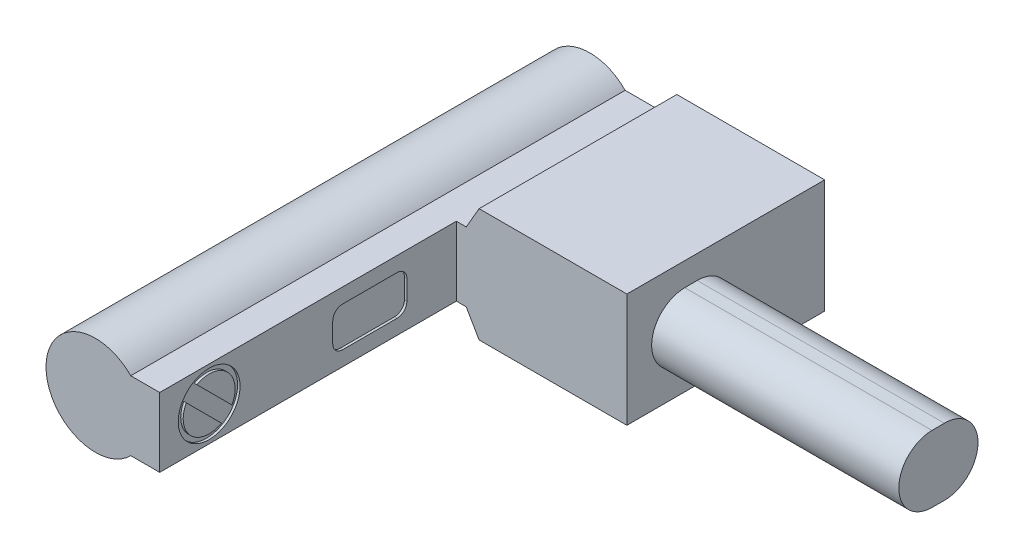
ISO-10303-21;
HEADER;
FILE_DESCRIPTION(('STEP AP214'),'2;1');
FILE_NAME('part.step','',(''),(''),'','','');
FILE_SCHEMA(('AUTOMOTIVE_DESIGN { 1 0 10303 214 1 1 1 1 }'));
ENDSEC;
DATA;
#1=APPLICATION_CONTEXT('core data for automotive mechanical design processes');
#2=APPLICATION_PROTOCOL_DEFINITION('international standard','automotive_design',2000,#1);
#3=PRODUCT_CONTEXT('',#1,'mechanical');
#4=PRODUCT('Part','Part','',(#3));
#5=PRODUCT_RELATED_PRODUCT_CATEGORY('part','',(#4));
#6=PRODUCT_DEFINITION_FORMATION('','',#4);
#7=PRODUCT_DEFINITION_CONTEXT('part definition',#1,'design');
#8=PRODUCT_DEFINITION('design','',#6,#7);
#9=PRODUCT_DEFINITION_SHAPE('','',#8);
#10=(LENGTH_UNIT() NAMED_UNIT(*) SI_UNIT(.MILLI.,.METRE.));
#11=(NAMED_UNIT(*) PLANE_ANGLE_UNIT() SI_UNIT($,.RADIAN.));
#12=(NAMED_UNIT(*) SI_UNIT($,.STERADIAN.) SOLID_ANGLE_UNIT());
#13=UNCERTAINTY_MEASURE_WITH_UNIT(LENGTH_MEASURE(1.E-05),#10,'distance_accuracy_value','');
#14=(GEOMETRIC_REPRESENTATION_CONTEXT(3) GLOBAL_UNCERTAINTY_ASSIGNED_CONTEXT((#13)) GLOBAL_UNIT_ASSIGNED_CONTEXT((#10,
#11,#12)) REPRESENTATION_CONTEXT('',''));
#15=CARTESIAN_POINT('',(0.,0.,0.));
#16=DIRECTION('',(0.,0.,1.));
#17=DIRECTION('',(1.,0.,0.));
#18=AXIS2_PLACEMENT_3D('',#15,#16,#17);
#19=CARTESIAN_POINT('',(2.6,-1.4,-20.));
#20=DIRECTION('',(1.,0.,0.));
#21=DIRECTION('',(0.,0.,-1.));
#22=AXIS2_PLACEMENT_3D('',#19,#20,#21);
#23=PLANE('',#22);
#24=DIRECTION('',(0.,0.707106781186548,0.707106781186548));
#25=VECTOR('',#24,1.);
#26=CARTESIAN_POINT('',(2.6,-0.609451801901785,-3.03371587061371));
#27=LINE('',#26,#25);
#28=CARTESIAN_POINT('',(2.6,0.92364450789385,-1.50061956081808));
#29=VERTEX_POINT('',#28);
#30=CARTESIAN_POINT('',(2.6,-0.499380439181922,-2.92364450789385));
#31=VERTEX_POINT('',#30);
#32=EDGE_CURVE('E146',#29,#31,#27,.F.);
#33=ORIENTED_EDGE('',*,*,#32,.T.);
#34=CARTESIAN_POINT('',(2.6,0.,-2.));
#35=DIRECTION('',(1.,0.,0.));
#36=DIRECTION('',(0.,0.,-1.));
#37=AXIS2_PLACEMENT_3D('',#34,#35,#36);
#38=CIRCLE('',#37,1.05);
#39=EDGE_CURVE('E20',#29,#31,#38,.F.);
#40=ORIENTED_EDGE('',*,*,#39,.F.);
#41=EDGE_LOOP('',(#33,#40));
#42=FACE_BOUND('',#41,.T.);
#43=ADVANCED_FACE('F17',(#42),#23,.T.);
#44=CARTESIAN_POINT('',(2.6,-1.4,-20.));
#45=DIRECTION('',(1.,0.,0.));
#46=DIRECTION('',(0.,0.,-1.));
#47=AXIS2_PLACEMENT_3D('',#44,#45,#46);
#48=PLANE('',#47);
#49=DIRECTION('',(0.,-0.707106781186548,-0.707106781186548));
#50=VECTOR('',#49,1.);
#51=CARTESIAN_POINT('',(2.6,0.609451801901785,-0.966284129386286));
#52=LINE('',#51,#50);
#53=CARTESIAN_POINT('',(2.6,-0.92364450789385,-2.49938043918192));
#54=VERTEX_POINT('',#53);
#55=CARTESIAN_POINT('',(2.6,0.499380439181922,-1.07635549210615));
#56=VERTEX_POINT('',#55);
#57=EDGE_CURVE('E167',#54,#56,#52,.F.);
#58=ORIENTED_EDGE('',*,*,#57,.T.);
#59=CARTESIAN_POINT('',(2.6,0.,-2.));
#60=DIRECTION('',(1.,0.,0.));
#61=DIRECTION('',(0.,0.,-1.));
#62=AXIS2_PLACEMENT_3D('',#59,#60,#61);
#63=CIRCLE('',#62,1.05);
#64=EDGE_CURVE('E158',#54,#56,#63,.F.);
#65=ORIENTED_EDGE('',*,*,#64,.F.);
#66=EDGE_LOOP('',(#58,#65));
#67=FACE_BOUND('',#66,.T.);
#68=ADVANCED_FACE('F560',(#67),#48,.T.);
#69=CARTESIAN_POINT('',(2.5,-0.609451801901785,-3.03371587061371));
#70=DIRECTION('',(0.,0.707106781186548,-0.707106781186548));
#71=DIRECTION('',(0.,0.707106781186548,0.707106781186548));
#72=AXIS2_PLACEMENT_3D('',#69,#70,#71);
#73=PLANE('',#72);
#74=DIRECTION('',(0.,0.707106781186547,0.707106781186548));
#75=VECTOR('',#74,1.);
#76=CARTESIAN_POINT('',(2.5,-0.499380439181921,-2.92364450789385));
#77=LINE('',#76,#75);
#78=CARTESIAN_POINT('',(2.5,-0.499380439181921,-2.92364450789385));
#79=VERTEX_POINT('',#78);
#80=CARTESIAN_POINT('',(2.5,0.92364450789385,-1.50061956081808));
#81=VERTEX_POINT('',#80);
#82=EDGE_CURVE('E162',#79,#81,#77,.T.);
#83=ORIENTED_EDGE('',*,*,#82,.F.);
#84=DIRECTION('',(1.,0.,0.));
#85=VECTOR('',#84,1.);
#86=CARTESIAN_POINT('',(2.5,-0.499380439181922,-2.92364450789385));
#87=LINE('',#86,#85);
#88=EDGE_CURVE('E154',#31,#79,#87,.F.);
#89=ORIENTED_EDGE('',*,*,#88,.F.);
#90=ORIENTED_EDGE('',*,*,#32,.F.);
#91=DIRECTION('',(1.,0.,0.));
#92=VECTOR('',#91,1.);
#93=CARTESIAN_POINT('',(2.5,0.923644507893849,-1.50061956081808));
#94=LINE('',#93,#92);
#95=EDGE_CURVE('E156',#81,#29,#94,.T.);
#96=ORIENTED_EDGE('',*,*,#95,.F.);
#97=EDGE_LOOP('',(#83,#89,#90,#96));
#98=FACE_BOUND('',#97,.T.);
#99=ADVANCED_FACE('F160',(#98),#73,.F.);
#100=CARTESIAN_POINT('',(2.5,0.,-2.));
#101=DIRECTION('',(1.,0.,0.));
#102=DIRECTION('',(0.,0.,-1.));
#103=AXIS2_PLACEMENT_3D('',#100,#101,#102);
#104=CYLINDRICAL_SURFACE('',#103,1.05);
#105=ORIENTED_EDGE('',*,*,#95,.T.);
#106=ORIENTED_EDGE('',*,*,#39,.T.);
#107=ORIENTED_EDGE('',*,*,#88,.T.);
#108=CARTESIAN_POINT('',(2.5,0.,-2.));
#109=DIRECTION('',(1.,0.,0.));
#110=DIRECTION('',(0.,0.,-1.));
#111=AXIS2_PLACEMENT_3D('',#108,#109,#110);
#112=CIRCLE('',#111,1.05);
#113=EDGE_CURVE('E238',#81,#79,#112,.F.);
#114=ORIENTED_EDGE('',*,*,#113,.F.);
#115=EDGE_LOOP('',(#105,#106,#107,#114));
#116=FACE_BOUND('',#115,.T.);
#117=ADVANCED_FACE('F152',(#116),#104,.T.);
#118=CARTESIAN_POINT('',(2.5,0.,-2.));
#119=DIRECTION('',(1.,0.,0.));
#120=DIRECTION('',(0.,0.,-1.));
#121=AXIS2_PLACEMENT_3D('',#118,#119,#120);
#122=CYLINDRICAL_SURFACE('',#121,1.05);
#123=DIRECTION('',(1.,0.,0.));
#124=VECTOR('',#123,1.);
#125=CARTESIAN_POINT('',(2.5,0.499380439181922,-1.07635549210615));
#126=LINE('',#125,#124);
#127=CARTESIAN_POINT('',(2.5,0.499380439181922,-1.07635549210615));
#128=VERTEX_POINT('',#127);
#129=EDGE_CURVE('E168',#56,#128,#126,.F.);
#130=ORIENTED_EDGE('',*,*,#129,.T.);
#131=CARTESIAN_POINT('',(2.5,0.,-2.));
#132=DIRECTION('',(1.,0.,0.));
#133=DIRECTION('',(0.,0.,-1.));
#134=AXIS2_PLACEMENT_3D('',#131,#132,#133);
#135=CIRCLE('',#134,1.05);
#136=CARTESIAN_POINT('',(2.5,-0.92364450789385,-2.49938043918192));
#137=VERTEX_POINT('',#136);
#138=EDGE_CURVE('E234',#137,#128,#135,.F.);
#139=ORIENTED_EDGE('',*,*,#138,.F.);
#140=DIRECTION('',(1.,0.,0.));
#141=VECTOR('',#140,1.);
#142=CARTESIAN_POINT('',(2.5,-0.92364450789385,-2.49938043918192));
#143=LINE('',#142,#141);
#144=EDGE_CURVE('E246',#137,#54,#143,.T.);
#145=ORIENTED_EDGE('',*,*,#144,.T.);
#146=ORIENTED_EDGE('',*,*,#64,.T.);
#147=EDGE_LOOP('',(#130,#139,#145,#146));
#148=FACE_BOUND('',#147,.T.);
#149=ADVANCED_FACE('F243',(#148),#122,.T.);
#150=CARTESIAN_POINT('',(2.5,0.609451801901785,-0.966284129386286));
#151=DIRECTION('',(0.,-0.707106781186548,0.707106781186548));
#152=DIRECTION('',(0.,-0.707106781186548,-0.707106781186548));
#153=AXIS2_PLACEMENT_3D('',#150,#151,#152);
#154=PLANE('',#153);
#155=DIRECTION('',(0.,-0.707106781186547,-0.707106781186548));
#156=VECTOR('',#155,1.);
#157=CARTESIAN_POINT('',(2.5,0.499380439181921,-1.07635549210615));
#158=LINE('',#157,#156);
#159=EDGE_CURVE('E237',#128,#137,#158,.T.);
#160=ORIENTED_EDGE('',*,*,#159,.F.);
#161=ORIENTED_EDGE('',*,*,#129,.F.);
#162=ORIENTED_EDGE('',*,*,#57,.F.);
#163=ORIENTED_EDGE('',*,*,#144,.F.);
#164=EDGE_LOOP('',(#160,#161,#162,#163));
#165=FACE_BOUND('',#164,.T.);
#166=ADVANCED_FACE('F250',(#165),#154,.F.);
#167=CARTESIAN_POINT('',(19.5,-1.3499756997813,-14.3419));
#168=DIRECTION('',(0.,0.999981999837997,-0.00599999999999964));
#169=DIRECTION('',(0.,0.00599999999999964,0.999981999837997));
#170=AXIS2_PLACEMENT_3D('',#167,#168,#169);
#171=PLANE('',#170);
#172=DIRECTION('',(-1.,0.,0.));
#173=VECTOR('',#172,1.);
#174=CARTESIAN_POINT('',(19.5,-1.35297564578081,-14.841882));
#175=LINE('',#174,#173);
#176=CARTESIAN_POINT('',(19.5,-1.35297564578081,-14.841882));
#177=VERTEX_POINT('',#176);
#178=CARTESIAN_POINT('',(9.5,-1.35297564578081,-14.841882));
#179=VERTEX_POINT('',#178);
#180=EDGE_CURVE('E229',#177,#179,#175,.T.);
#181=ORIENTED_EDGE('',*,*,#180,.F.);
#182=DIRECTION('',(0.,-0.00599999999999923,-0.999981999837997));
#183=VECTOR('',#182,1.);
#184=CARTESIAN_POINT('',(19.5,-1.3499756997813,-14.3419));
#185=LINE('',#184,#183);
#186=CARTESIAN_POINT('',(19.5,-1.3499756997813,-14.3419));
#187=VERTEX_POINT('',#186);
#188=EDGE_CURVE('E257',#187,#177,#185,.T.);
#189=ORIENTED_EDGE('',*,*,#188,.F.);
#190=DIRECTION('',(-1.,0.,0.));
#191=VECTOR('',#190,1.);
#192=CARTESIAN_POINT('',(19.5,-1.3499756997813,-14.3419));
#193=LINE('',#192,#191);
#194=CARTESIAN_POINT('',(9.5,-1.3499756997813,-14.3419));
#195=VERTEX_POINT('',#194);
#196=EDGE_CURVE('E273',#195,#187,#193,.F.);
#197=ORIENTED_EDGE('',*,*,#196,.F.);
#198=DIRECTION('',(0.,0.00599999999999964,0.999981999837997));
#199=VECTOR('',#198,1.);
#200=CARTESIAN_POINT('',(9.5,-1.3499756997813,-14.3419));
#201=LINE('',#200,#199);
#202=EDGE_CURVE('E253',#179,#195,#201,.T.);
#203=ORIENTED_EDGE('',*,*,#202,.F.);
#204=EDGE_LOOP('',(#181,#189,#197,#203));
#205=FACE_BOUND('',#204,.T.);
#206=ADVANCED_FACE('F536',(#205),#171,.F.);
#207=CARTESIAN_POINT('',(19.5,0.,-14.35));
#208=DIRECTION('',(1.,0.,0.));
#209=DIRECTION('',(0.,0.,-1.));
#210=AXIS2_PLACEMENT_3D('',#207,#208,#209);
#211=PLANE('',#210);
#212=CARTESIAN_POINT('',(19.5,0.,-14.85));
#213=DIRECTION('',(-1.,0.,0.));
#214=DIRECTION('',(0.,0.,1.));
#215=AXIS2_PLACEMENT_3D('',#212,#213,#214);
#216=CIRCLE('',#215,1.353);
#217=CARTESIAN_POINT('',(19.5,1.35297564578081,-14.841882));
#218=VERTEX_POINT('',#217);
#219=EDGE_CURVE('E230',#218,#177,#216,.T.);
#220=ORIENTED_EDGE('',*,*,#219,.F.);
#221=DIRECTION('',(0.,0.00599999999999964,-0.999981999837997));
#222=VECTOR('',#221,1.);
#223=CARTESIAN_POINT('',(19.5,1.35297564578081,-14.841882));
#224=LINE('',#223,#222);
#225=CARTESIAN_POINT('',(19.5,1.3499756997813,-14.3419));
#226=VERTEX_POINT('',#225);
#227=EDGE_CURVE('E259',#218,#226,#224,.F.);
#228=ORIENTED_EDGE('',*,*,#227,.T.);
#229=CARTESIAN_POINT('',(19.5,0.,-14.35));
#230=DIRECTION('',(-1.,0.,0.));
#231=DIRECTION('',(0.,0.,1.));
#232=AXIS2_PLACEMENT_3D('',#229,#230,#231);
#233=CIRCLE('',#232,1.35);
#234=EDGE_CURVE('E226',#187,#226,#233,.T.);
#235=ORIENTED_EDGE('',*,*,#234,.F.);
#236=ORIENTED_EDGE('',*,*,#188,.T.);
#237=EDGE_LOOP('',(#220,#228,#235,#236));
#238=FACE_BOUND('',#237,.T.);
#239=ADVANCED_FACE('F541',(#238),#211,.T.);
#240=CARTESIAN_POINT('',(19.5,1.35297564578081,-14.841882));
#241=DIRECTION('',(0.,-0.999981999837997,-0.00599999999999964));
#242=DIRECTION('',(0.,0.00599999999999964,-0.999981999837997));
#243=AXIS2_PLACEMENT_3D('',#240,#241,#242);
#244=PLANE('',#243);
#245=DIRECTION('',(-1.,0.,0.));
#246=VECTOR('',#245,1.);
#247=CARTESIAN_POINT('',(19.5,1.3499756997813,-14.3419));
#248=LINE('',#247,#246);
#249=CARTESIAN_POINT('',(9.5,1.3499756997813,-14.3419));
#250=VERTEX_POINT('',#249);
#251=EDGE_CURVE('E225',#226,#250,#248,.T.);
#252=ORIENTED_EDGE('',*,*,#251,.F.);
#253=ORIENTED_EDGE('',*,*,#227,.F.);
#254=DIRECTION('',(-1.,0.,0.));
#255=VECTOR('',#254,1.);
#256=CARTESIAN_POINT('',(19.5,1.35297564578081,-14.841882));
#257=LINE('',#256,#255);
#258=CARTESIAN_POINT('',(9.5,1.35297564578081,-14.841882));
#259=VERTEX_POINT('',#258);
#260=EDGE_CURVE('E233',#259,#218,#257,.F.);
#261=ORIENTED_EDGE('',*,*,#260,.F.);
#262=DIRECTION('',(0.,0.00599999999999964,-0.999981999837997));
#263=VECTOR('',#262,1.);
#264=CARTESIAN_POINT('',(9.5,1.35297564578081,-14.841882));
#265=LINE('',#264,#263);
#266=EDGE_CURVE('E261',#250,#259,#265,.T.);
#267=ORIENTED_EDGE('',*,*,#266,.F.);
#268=EDGE_LOOP('',(#252,#253,#261,#267));
#269=FACE_BOUND('',#268,.T.);
#270=ADVANCED_FACE('F529',(#269),#244,.F.);
#271=CARTESIAN_POINT('',(2.5,-0.400000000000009,-7.4));
#272=DIRECTION('',(1.,0.,0.));
#273=DIRECTION('',(0.,0.,-1.));
#274=AXIS2_PLACEMENT_3D('',#271,#272,#273);
#275=PLANE('',#274);
#276=CARTESIAN_POINT('',(2.5,0.399999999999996,-7.4));
#277=DIRECTION('',(1.,0.,0.));
#278=DIRECTION('',(0.,0.,-1.));
#279=AXIS2_PLACEMENT_3D('',#276,#277,#278);
#280=CIRCLE('',#279,0.4);
#281=CARTESIAN_POINT('',(2.5,0.799999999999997,-7.4));
#282=VERTEX_POINT('',#281);
#283=CARTESIAN_POINT('',(2.5,0.399999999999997,-7.));
#284=VERTEX_POINT('',#283);
#285=EDGE_CURVE('E218',#282,#284,#280,.T.);
#286=ORIENTED_EDGE('',*,*,#285,.T.);
#287=DIRECTION('',(0.,1.,0.));
#288=VECTOR('',#287,1.);
#289=CARTESIAN_POINT('',(2.5,0.399999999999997,-7.));
#290=LINE('',#289,#288);
#291=CARTESIAN_POINT('',(2.5,-0.40000000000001,-7.));
#292=VERTEX_POINT('',#291);
#293=EDGE_CURVE('E224',#284,#292,#290,.F.);
#294=ORIENTED_EDGE('',*,*,#293,.T.);
#295=CARTESIAN_POINT('',(2.5,-0.400000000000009,-7.4));
#296=DIRECTION('',(1.,0.,0.));
#297=DIRECTION('',(0.,0.,-1.));
#298=AXIS2_PLACEMENT_3D('',#295,#296,#297);
#299=CIRCLE('',#298,0.400000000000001);
#300=CARTESIAN_POINT('',(2.5,-0.80000000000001,-7.4));
#301=VERTEX_POINT('',#300);
#302=EDGE_CURVE('E222',#292,#301,#299,.T.);
#303=ORIENTED_EDGE('',*,*,#302,.T.);
#304=DIRECTION('',(0.,0.,-1.));
#305=VECTOR('',#304,1.);
#306=CARTESIAN_POINT('',(2.5,-0.80000000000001,-7.4));
#307=LINE('',#306,#305);
#308=CARTESIAN_POINT('',(2.5,-0.800000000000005,-9.6));
#309=VERTEX_POINT('',#308);
#310=EDGE_CURVE('E268',#301,#309,#307,.T.);
#311=ORIENTED_EDGE('',*,*,#310,.T.);
#312=CARTESIAN_POINT('',(2.5,-0.400000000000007,-9.6));
#313=DIRECTION('',(1.,0.,0.));
#314=DIRECTION('',(0.,0.,-1.));
#315=AXIS2_PLACEMENT_3D('',#312,#313,#314);
#316=CIRCLE('',#315,0.399999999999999);
#317=CARTESIAN_POINT('',(2.5,-0.400000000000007,-10.));
#318=VERTEX_POINT('',#317);
#319=EDGE_CURVE('E210',#309,#318,#316,.T.);
#320=ORIENTED_EDGE('',*,*,#319,.T.);
#321=DIRECTION('',(0.,1.,0.));
#322=VECTOR('',#321,1.);
#323=CARTESIAN_POINT('',(2.5,-0.400000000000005,-10.));
#324=LINE('',#323,#322);
#325=CARTESIAN_POINT('',(2.5,0.399999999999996,-10.));
#326=VERTEX_POINT('',#325);
#327=EDGE_CURVE('E266',#318,#326,#324,.T.);
#328=ORIENTED_EDGE('',*,*,#327,.T.);
#329=CARTESIAN_POINT('',(2.5,0.399999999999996,-9.6));
#330=DIRECTION('',(1.,0.,0.));
#331=DIRECTION('',(0.,0.,-1.));
#332=AXIS2_PLACEMENT_3D('',#329,#330,#331);
#333=CIRCLE('',#332,0.400000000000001);
#334=CARTESIAN_POINT('',(2.5,0.799999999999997,-9.6));
#335=VERTEX_POINT('',#334);
#336=EDGE_CURVE('E214',#326,#335,#333,.T.);
#337=ORIENTED_EDGE('',*,*,#336,.T.);
#338=DIRECTION('',(0.,0.,1.));
#339=VECTOR('',#338,1.);
#340=CARTESIAN_POINT('',(2.5,0.799999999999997,-9.6));
#341=LINE('',#340,#339);
#342=EDGE_CURVE('E264',#335,#282,#341,.T.);
#343=ORIENTED_EDGE('',*,*,#342,.T.);
#344=EDGE_LOOP('',(#286,#294,#303,#311,#320,#328,#337,#343));
#345=FACE_BOUND('',#344,.T.);
#346=ADVANCED_FACE('F548',(#345),#275,.T.);
#347=CARTESIAN_POINT('',(2.5,0.,-2.));
#348=DIRECTION('',(1.,0.,0.));
#349=DIRECTION('',(0.,0.,-1.));
#350=AXIS2_PLACEMENT_3D('',#347,#348,#349);
#351=PLANE('',#350);
#352=CARTESIAN_POINT('',(2.5,0.,-2.));
#353=DIRECTION('',(1.,0.,0.));
#354=DIRECTION('',(0.,0.,-1.));
#355=AXIS2_PLACEMENT_3D('',#352,#353,#354);
#356=CIRCLE('',#355,1.25);
#357=CARTESIAN_POINT('',(2.5,0.,-3.25));
#358=VERTEX_POINT('',#357);
#359=EDGE_CURVE('E205',#358,#358,#356,.T.);
#360=ORIENTED_EDGE('',*,*,#359,.T.);
#361=EDGE_LOOP('',(#360));
#362=FACE_BOUND('',#361,.T.);
#363=ORIENTED_EDGE('',*,*,#138,.T.);
#364=ORIENTED_EDGE('',*,*,#159,.T.);
#365=EDGE_LOOP('',(#363,#364));
#366=FACE_BOUND('',#365,.T.);
#367=ORIENTED_EDGE('',*,*,#82,.T.);
#368=ORIENTED_EDGE('',*,*,#113,.T.);
#369=EDGE_LOOP('',(#367,#368));
#370=FACE_BOUND('',#369,.T.);
#371=ADVANCED_FACE('F625',(#362,#366,#370),#351,.T.);
#372=CARTESIAN_POINT('',(19.5,0.,-14.85));
#373=DIRECTION('',(-1.,0.,0.));
#374=DIRECTION('',(0.,0.,1.));
#375=AXIS2_PLACEMENT_3D('',#372,#373,#374);
#376=CYLINDRICAL_SURFACE('',#375,1.353);
#377=ORIENTED_EDGE('',*,*,#219,.T.);
#378=ORIENTED_EDGE('',*,*,#180,.T.);
#379=CARTESIAN_POINT('',(9.5,0.,-14.85));
#380=DIRECTION('',(-1.,0.,0.));
#381=DIRECTION('',(0.,0.,1.));
#382=AXIS2_PLACEMENT_3D('',#379,#380,#381);
#383=CIRCLE('',#382,1.353);
#384=EDGE_CURVE('E201',#179,#259,#383,.F.);
#385=ORIENTED_EDGE('',*,*,#384,.T.);
#386=ORIENTED_EDGE('',*,*,#260,.T.);
#387=EDGE_LOOP('',(#377,#378,#385,#386));
#388=FACE_BOUND('',#387,.T.);
#389=ADVANCED_FACE('F532',(#388),#376,.T.);
#390=CARTESIAN_POINT('',(19.5,0.,-14.35));
#391=DIRECTION('',(-1.,0.,0.));
#392=DIRECTION('',(0.,0.,1.));
#393=AXIS2_PLACEMENT_3D('',#390,#391,#392);
#394=CYLINDRICAL_SURFACE('',#393,1.35);
#395=ORIENTED_EDGE('',*,*,#251,.T.);
#396=CARTESIAN_POINT('',(9.5,0.,-14.35));
#397=DIRECTION('',(-1.,0.,0.));
#398=DIRECTION('',(0.,0.,1.));
#399=AXIS2_PLACEMENT_3D('',#396,#397,#398);
#400=CIRCLE('',#399,1.35);
#401=EDGE_CURVE('E198',#250,#195,#400,.F.);
#402=ORIENTED_EDGE('',*,*,#401,.T.);
#403=ORIENTED_EDGE('',*,*,#196,.T.);
#404=ORIENTED_EDGE('',*,*,#234,.T.);
#405=EDGE_LOOP('',(#395,#402,#403,#404));
#406=FACE_BOUND('',#405,.T.);
#407=ADVANCED_FACE('F539',(#406),#394,.T.);
#408=CARTESIAN_POINT('',(2.5,-0.400000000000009,-7.4));
#409=DIRECTION('',(1.,0.,0.));
#410=DIRECTION('',(0.,0.,-1.));
#411=AXIS2_PLACEMENT_3D('',#408,#409,#410);
#412=CYLINDRICAL_SURFACE('',#411,0.400000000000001);
#413=DIRECTION('',(1.,0.,0.));
#414=VECTOR('',#413,1.);
#415=CARTESIAN_POINT('',(2.5,-0.80000000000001,-7.4));
#416=LINE('',#415,#414);
#417=CARTESIAN_POINT('',(2.6,-0.800000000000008,-7.4));
#418=VERTEX_POINT('',#417);
#419=EDGE_CURVE('E270',#418,#301,#416,.F.);
#420=ORIENTED_EDGE('',*,*,#419,.T.);
#421=ORIENTED_EDGE('',*,*,#302,.F.);
#422=DIRECTION('',(1.,0.,0.));
#423=VECTOR('',#422,1.);
#424=CARTESIAN_POINT('',(2.5,-0.40000000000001,-7.));
#425=LINE('',#424,#423);
#426=CARTESIAN_POINT('',(2.6,-0.40000000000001,-7.));
#427=VERTEX_POINT('',#426);
#428=EDGE_CURVE('E221',#292,#427,#425,.T.);
#429=ORIENTED_EDGE('',*,*,#428,.T.);
#430=CARTESIAN_POINT('',(2.6,-0.400000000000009,-7.4));
#431=DIRECTION('',(1.,0.,0.));
#432=DIRECTION('',(0.,0.,-1.));
#433=AXIS2_PLACEMENT_3D('',#430,#431,#432);
#434=CIRCLE('',#433,0.400000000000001);
#435=EDGE_CURVE('E194',#418,#427,#434,.F.);
#436=ORIENTED_EDGE('',*,*,#435,.F.);
#437=EDGE_LOOP('',(#420,#421,#429,#436));
#438=FACE_BOUND('',#437,.T.);
#439=ADVANCED_FACE('F651',(#438),#412,.F.);
#440=CARTESIAN_POINT('',(2.5,0.399999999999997,-7.));
#441=DIRECTION('',(0.,0.,1.));
#442=DIRECTION('',(1.,0.,0.));
#443=AXIS2_PLACEMENT_3D('',#440,#441,#442);
#444=PLANE('',#443);
#445=ORIENTED_EDGE('',*,*,#428,.F.);
#446=ORIENTED_EDGE('',*,*,#293,.F.);
#447=DIRECTION('',(1.,0.,0.));
#448=VECTOR('',#447,1.);
#449=CARTESIAN_POINT('',(2.5,0.399999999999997,-7.));
#450=LINE('',#449,#448);
#451=CARTESIAN_POINT('',(2.6,0.399999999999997,-7.));
#452=VERTEX_POINT('',#451);
#453=EDGE_CURVE('E220',#284,#452,#450,.T.);
#454=ORIENTED_EDGE('',*,*,#453,.T.);
#455=DIRECTION('',(0.,1.,0.));
#456=VECTOR('',#455,1.);
#457=CARTESIAN_POINT('',(2.6,-1.4,-7.));
#458=LINE('',#457,#456);
#459=EDGE_CURVE('E193',#427,#452,#458,.T.);
#460=ORIENTED_EDGE('',*,*,#459,.F.);
#461=EDGE_LOOP('',(#445,#446,#454,#460));
#462=FACE_BOUND('',#461,.T.);
#463=ADVANCED_FACE('F660',(#462),#444,.F.);
#464=CARTESIAN_POINT('',(2.5,0.399999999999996,-7.4));
#465=DIRECTION('',(1.,0.,0.));
#466=DIRECTION('',(0.,0.,-1.));
#467=AXIS2_PLACEMENT_3D('',#464,#465,#466);
#468=CYLINDRICAL_SURFACE('',#467,0.4);
#469=ORIENTED_EDGE('',*,*,#453,.F.);
#470=ORIENTED_EDGE('',*,*,#285,.F.);
#471=DIRECTION('',(1.,0.,0.));
#472=VECTOR('',#471,1.);
#473=CARTESIAN_POINT('',(2.5,0.799999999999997,-7.4));
#474=LINE('',#473,#472);
#475=CARTESIAN_POINT('',(2.6,0.799999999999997,-7.4));
#476=VERTEX_POINT('',#475);
#477=EDGE_CURVE('E217',#282,#476,#474,.T.);
#478=ORIENTED_EDGE('',*,*,#477,.T.);
#479=CARTESIAN_POINT('',(2.6,0.399999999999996,-7.4));
#480=DIRECTION('',(1.,0.,0.));
#481=DIRECTION('',(0.,0.,-1.));
#482=AXIS2_PLACEMENT_3D('',#479,#480,#481);
#483=CIRCLE('',#482,0.4);
#484=EDGE_CURVE('E190',#452,#476,#483,.F.);
#485=ORIENTED_EDGE('',*,*,#484,.F.);
#486=EDGE_LOOP('',(#469,#470,#478,#485));
#487=FACE_BOUND('',#486,.T.);
#488=ADVANCED_FACE('F670',(#487),#468,.F.);
#489=CARTESIAN_POINT('',(2.5,0.799999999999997,-9.6));
#490=DIRECTION('',(0.,1.,0.));
#491=DIRECTION('',(0.,0.,1.));
#492=AXIS2_PLACEMENT_3D('',#489,#490,#491);
#493=PLANE('',#492);
#494=ORIENTED_EDGE('',*,*,#477,.F.);
#495=ORIENTED_EDGE('',*,*,#342,.F.);
#496=DIRECTION('',(1.,0.,0.));
#497=VECTOR('',#496,1.);
#498=CARTESIAN_POINT('',(2.5,0.799999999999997,-9.6));
#499=LINE('',#498,#497);
#500=CARTESIAN_POINT('',(2.6,0.799999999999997,-9.6));
#501=VERTEX_POINT('',#500);
#502=EDGE_CURVE('E216',#335,#501,#499,.T.);
#503=ORIENTED_EDGE('',*,*,#502,.T.);
#504=DIRECTION('',(0.,0.,-1.));
#505=VECTOR('',#504,1.);
#506=CARTESIAN_POINT('',(2.6,0.799999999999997,-20.));
#507=LINE('',#506,#505);
#508=EDGE_CURVE('E189',#476,#501,#507,.T.);
#509=ORIENTED_EDGE('',*,*,#508,.F.);
#510=EDGE_LOOP('',(#494,#495,#503,#509));
#511=FACE_BOUND('',#510,.T.);
#512=ADVANCED_FACE('F680',(#511),#493,.F.);
#513=CARTESIAN_POINT('',(2.5,0.399999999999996,-9.6));
#514=DIRECTION('',(1.,0.,0.));
#515=DIRECTION('',(0.,0.,-1.));
#516=AXIS2_PLACEMENT_3D('',#513,#514,#515);
#517=CYLINDRICAL_SURFACE('',#516,0.400000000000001);
#518=ORIENTED_EDGE('',*,*,#502,.F.);
#519=ORIENTED_EDGE('',*,*,#336,.F.);
#520=DIRECTION('',(-1.,0.,0.));
#521=VECTOR('',#520,1.);
#522=CARTESIAN_POINT('',(2.5,0.399999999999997,-10.));
#523=LINE('',#522,#521);
#524=CARTESIAN_POINT('',(2.6,0.399999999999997,-10.));
#525=VERTEX_POINT('',#524);
#526=EDGE_CURVE('E213',#326,#525,#523,.F.);
#527=ORIENTED_EDGE('',*,*,#526,.T.);
#528=CARTESIAN_POINT('',(2.6,0.399999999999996,-9.6));
#529=DIRECTION('',(1.,0.,0.));
#530=DIRECTION('',(0.,0.,-1.));
#531=AXIS2_PLACEMENT_3D('',#528,#529,#530);
#532=CIRCLE('',#531,0.400000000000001);
#533=EDGE_CURVE('E186',#501,#525,#532,.F.);
#534=ORIENTED_EDGE('',*,*,#533,.F.);
#535=EDGE_LOOP('',(#518,#519,#527,#534));
#536=FACE_BOUND('',#535,.T.);
#537=ADVANCED_FACE('F690',(#536),#517,.F.);
#538=CARTESIAN_POINT('',(2.5,-0.400000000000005,-10.));
#539=DIRECTION('',(0.,0.,-1.));
#540=DIRECTION('',(-1.,0.,0.));
#541=AXIS2_PLACEMENT_3D('',#538,#539,#540);
#542=PLANE('',#541);
#543=ORIENTED_EDGE('',*,*,#526,.F.);
#544=ORIENTED_EDGE('',*,*,#327,.F.);
#545=DIRECTION('',(1.,0.,0.));
#546=VECTOR('',#545,1.);
#547=CARTESIAN_POINT('',(2.5,-0.400000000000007,-10.));
#548=LINE('',#547,#546);
#549=CARTESIAN_POINT('',(2.6,-0.400000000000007,-10.));
#550=VERTEX_POINT('',#549);
#551=EDGE_CURVE('E212',#318,#550,#548,.T.);
#552=ORIENTED_EDGE('',*,*,#551,.T.);
#553=DIRECTION('',(0.,1.,0.));
#554=VECTOR('',#553,1.);
#555=CARTESIAN_POINT('',(2.6,-1.4,-10.));
#556=LINE('',#555,#554);
#557=EDGE_CURVE('E185',#525,#550,#556,.F.);
#558=ORIENTED_EDGE('',*,*,#557,.F.);
#559=EDGE_LOOP('',(#543,#544,#552,#558));
#560=FACE_BOUND('',#559,.T.);
#561=ADVANCED_FACE('F700',(#560),#542,.F.);
#562=CARTESIAN_POINT('',(2.5,-0.400000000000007,-9.6));
#563=DIRECTION('',(1.,0.,0.));
#564=DIRECTION('',(0.,0.,-1.));
#565=AXIS2_PLACEMENT_3D('',#562,#563,#564);
#566=CYLINDRICAL_SURFACE('',#565,0.399999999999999);
#567=ORIENTED_EDGE('',*,*,#551,.F.);
#568=ORIENTED_EDGE('',*,*,#319,.F.);
#569=DIRECTION('',(1.,0.,0.));
#570=VECTOR('',#569,1.);
#571=CARTESIAN_POINT('',(2.5,-0.800000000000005,-9.6));
#572=LINE('',#571,#570);
#573=CARTESIAN_POINT('',(2.6,-0.800000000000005,-9.6));
#574=VERTEX_POINT('',#573);
#575=EDGE_CURVE('E209',#309,#574,#572,.T.);
#576=ORIENTED_EDGE('',*,*,#575,.T.);
#577=CARTESIAN_POINT('',(2.6,-0.400000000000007,-9.6));
#578=DIRECTION('',(1.,0.,0.));
#579=DIRECTION('',(0.,0.,-1.));
#580=AXIS2_PLACEMENT_3D('',#577,#578,#579);
#581=CIRCLE('',#580,0.399999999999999);
#582=EDGE_CURVE('E182',#550,#574,#581,.F.);
#583=ORIENTED_EDGE('',*,*,#582,.F.);
#584=EDGE_LOOP('',(#567,#568,#576,#583));
#585=FACE_BOUND('',#584,.T.);
#586=ADVANCED_FACE('F710',(#585),#566,.F.);
#587=CARTESIAN_POINT('',(2.5,-0.80000000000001,-7.4));
#588=DIRECTION('',(0.,-1.,0.));
#589=DIRECTION('',(0.,0.,-1.));
#590=AXIS2_PLACEMENT_3D('',#587,#588,#589);
#591=PLANE('',#590);
#592=ORIENTED_EDGE('',*,*,#575,.F.);
#593=ORIENTED_EDGE('',*,*,#310,.F.);
#594=ORIENTED_EDGE('',*,*,#419,.F.);
#595=DIRECTION('',(0.,0.,-1.));
#596=VECTOR('',#595,1.);
#597=CARTESIAN_POINT('',(2.6,-0.800000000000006,-20.));
#598=LINE('',#597,#596);
#599=EDGE_CURVE('E181',#574,#418,#598,.F.);
#600=ORIENTED_EDGE('',*,*,#599,.F.);
#601=EDGE_LOOP('',(#592,#593,#594,#600));
#602=FACE_BOUND('',#601,.T.);
#603=ADVANCED_FACE('F720',(#602),#591,.F.);
#604=CARTESIAN_POINT('',(2.5,0.,-2.));
#605=DIRECTION('',(1.,0.,0.));
#606=DIRECTION('',(0.,0.,-1.));
#607=AXIS2_PLACEMENT_3D('',#604,#605,#606);
#608=CYLINDRICAL_SURFACE('',#607,1.25);
#609=CARTESIAN_POINT('',(2.6,0.,-2.));
#610=DIRECTION('',(1.,0.,0.));
#611=DIRECTION('',(0.,0.,-1.));
#612=AXIS2_PLACEMENT_3D('',#609,#610,#611);
#613=CIRCLE('',#612,1.25);
#614=CARTESIAN_POINT('',(2.6,0.,-3.25));
#615=VERTEX_POINT('',#614);
#616=EDGE_CURVE('E177',#615,#615,#613,.F.);
#617=ORIENTED_EDGE('',*,*,#616,.F.);
#618=EDGE_LOOP('',(#617));
#619=FACE_BOUND('',#618,.T.);
#620=ORIENTED_EDGE('',*,*,#359,.F.);
#621=EDGE_LOOP('',(#620));
#622=FACE_BOUND('',#621,.T.);
#623=ADVANCED_FACE('F499',(#619,#622),#608,.F.);
#624=CARTESIAN_POINT('',(0.,0.,-12.));
#625=DIRECTION('',(0.,0.,1.));
#626=DIRECTION('',(1.,0.,0.));
#627=AXIS2_PLACEMENT_3D('',#624,#625,#626);
#628=PLANE('',#627);
#629=DIRECTION('',(1.,0.,0.));
#630=VECTOR('',#629,1.);
#631=CARTESIAN_POINT('',(9.5,2.3,-12.));
#632=LINE('',#631,#630);
#633=CARTESIAN_POINT('',(9.5,2.3,-12.));
#634=VERTEX_POINT('',#633);
#635=CARTESIAN_POINT('',(3.51961524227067,2.3,-12.));
#636=VERTEX_POINT('',#635);
#637=EDGE_CURVE('E281',#634,#636,#632,.F.);
#638=ORIENTED_EDGE('',*,*,#637,.T.);
#639=DIRECTION('',(0.5,0.866025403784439,0.));
#640=VECTOR('',#639,1.);
#641=CARTESIAN_POINT('',(3.51961524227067,2.3,-12.));
#642=LINE('',#641,#640);
#643=CARTESIAN_POINT('',(3.,1.4,-12.));
#644=VERTEX_POINT('',#643);
#645=EDGE_CURVE('E324',#636,#644,#642,.F.);
#646=ORIENTED_EDGE('',*,*,#645,.T.);
#647=DIRECTION('',(1.,0.,0.));
#648=VECTOR('',#647,1.);
#649=CARTESIAN_POINT('',(0.,1.4,-12.));
#650=LINE('',#649,#648);
#651=CARTESIAN_POINT('',(2.6,1.4,-12.));
#652=VERTEX_POINT('',#651);
#653=EDGE_CURVE('E208',#644,#652,#650,.F.);
#654=ORIENTED_EDGE('',*,*,#653,.T.);
#655=DIRECTION('',(0.,1.,0.));
#656=VECTOR('',#655,1.);
#657=CARTESIAN_POINT('',(2.6,-1.4,-12.));
#658=LINE('',#657,#656);
#659=CARTESIAN_POINT('',(2.60000000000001,-1.4,-12.));
#660=VERTEX_POINT('',#659);
#661=EDGE_CURVE('E180',#660,#652,#658,.T.);
#662=ORIENTED_EDGE('',*,*,#661,.F.);
#663=DIRECTION('',(1.,0.,0.));
#664=VECTOR('',#663,1.);
#665=CARTESIAN_POINT('',(0.,-1.4,-12.));
#666=LINE('',#665,#664);
#667=CARTESIAN_POINT('',(3.,-1.4,-12.));
#668=VERTEX_POINT('',#667);
#669=EDGE_CURVE('E289',#660,#668,#666,.T.);
#670=ORIENTED_EDGE('',*,*,#669,.T.);
#671=DIRECTION('',(-0.5,0.866025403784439,0.));
#672=VECTOR('',#671,1.);
#673=CARTESIAN_POINT('',(3.,-1.4,-12.));
#674=LINE('',#673,#672);
#675=CARTESIAN_POINT('',(3.51961524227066,-2.3,-12.));
#676=VERTEX_POINT('',#675);
#677=EDGE_CURVE('E301',#668,#676,#674,.F.);
#678=ORIENTED_EDGE('',*,*,#677,.T.);
#679=DIRECTION('',(-1.,0.,0.));
#680=VECTOR('',#679,1.);
#681=CARTESIAN_POINT('',(3.51961524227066,-2.3,-12.));
#682=LINE('',#681,#680);
#683=CARTESIAN_POINT('',(9.5,-2.3,-12.));
#684=VERTEX_POINT('',#683);
#685=EDGE_CURVE('E311',#676,#684,#682,.F.);
#686=ORIENTED_EDGE('',*,*,#685,.T.);
#687=DIRECTION('',(0.,1.,0.));
#688=VECTOR('',#687,1.);
#689=CARTESIAN_POINT('',(9.5,-2.3,-12.));
#690=LINE('',#689,#688);
#691=EDGE_CURVE('E204',#684,#634,#690,.T.);
#692=ORIENTED_EDGE('',*,*,#691,.T.);
#693=EDGE_LOOP('',(#638,#646,#654,#662,#670,#678,#686,#692));
#694=FACE_BOUND('',#693,.T.);
#695=ADVANCED_FACE('F479',(#694),#628,.T.);
#696=CARTESIAN_POINT('',(3.51961524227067,2.3,-12.));
#697=DIRECTION('',(0.866025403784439,-0.5,0.));
#698=DIRECTION('',(0.5,0.866025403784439,0.));
#699=AXIS2_PLACEMENT_3D('',#696,#697,#698);
#700=PLANE('',#699);
#701=DIRECTION('',(0.,0.,1.));
#702=VECTOR('',#701,1.);
#703=CARTESIAN_POINT('',(3.,1.4,-20.));
#704=LINE('',#703,#702);
#705=CARTESIAN_POINT('',(3.,1.4,-20.));
#706=VERTEX_POINT('',#705);
#707=EDGE_CURVE('E348',#644,#706,#704,.F.);
#708=ORIENTED_EDGE('',*,*,#707,.F.);
#709=ORIENTED_EDGE('',*,*,#645,.F.);
#710=DIRECTION('',(0.,0.,1.));
#711=VECTOR('',#710,1.);
#712=CARTESIAN_POINT('',(3.51961524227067,2.3,-12.));
#713=LINE('',#712,#711);
#714=CARTESIAN_POINT('',(3.51961524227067,2.3,-20.));
#715=VERTEX_POINT('',#714);
#716=EDGE_CURVE('E284',#636,#715,#713,.F.);
#717=ORIENTED_EDGE('',*,*,#716,.T.);
#718=DIRECTION('',(0.5,0.866025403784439,0.));
#719=VECTOR('',#718,1.);
#720=CARTESIAN_POINT('',(3.51961524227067,2.3,-20.));
#721=LINE('',#720,#719);
#722=EDGE_CURVE('E333',#706,#715,#721,.T.);
#723=ORIENTED_EDGE('',*,*,#722,.F.);
#724=EDGE_LOOP('',(#708,#709,#717,#723));
#725=FACE_BOUND('',#724,.T.);
#726=ADVANCED_FACE('F490',(#725),#700,.F.);
#727=CARTESIAN_POINT('',(3.51961524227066,-2.3,-12.));
#728=DIRECTION('',(0.,1.,0.));
#729=DIRECTION('',(-1.,0.,0.));
#730=AXIS2_PLACEMENT_3D('',#727,#728,#729);
#731=PLANE('',#730);
#732=DIRECTION('',(0.,0.,1.));
#733=VECTOR('',#732,1.);
#734=CARTESIAN_POINT('',(9.5,-2.3,-12.));
#735=LINE('',#734,#733);
#736=CARTESIAN_POINT('',(9.5,-2.3,-20.));
#737=VERTEX_POINT('',#736);
#738=EDGE_CURVE('E306',#737,#684,#735,.T.);
#739=ORIENTED_EDGE('',*,*,#738,.T.);
#740=ORIENTED_EDGE('',*,*,#685,.F.);
#741=DIRECTION('',(0.,0.,1.));
#742=VECTOR('',#741,1.);
#743=CARTESIAN_POINT('',(3.51961524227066,-2.3,-12.));
#744=LINE('',#743,#742);
#745=CARTESIAN_POINT('',(3.51961524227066,-2.3,-20.));
#746=VERTEX_POINT('',#745);
#747=EDGE_CURVE('E197',#676,#746,#744,.F.);
#748=ORIENTED_EDGE('',*,*,#747,.T.);
#749=DIRECTION('',(1.,0.,0.));
#750=VECTOR('',#749,1.);
#751=CARTESIAN_POINT('',(0.,-2.3,-20.));
#752=LINE('',#751,#750);
#753=EDGE_CURVE('E360',#746,#737,#752,.T.);
#754=ORIENTED_EDGE('',*,*,#753,.T.);
#755=EDGE_LOOP('',(#739,#740,#748,#754));
#756=FACE_BOUND('',#755,.T.);
#757=ADVANCED_FACE('F480',(#756),#731,.F.);
#758=CARTESIAN_POINT('',(9.5,-2.3,-12.));
#759=DIRECTION('',(-1.,0.,0.));
#760=DIRECTION('',(0.,0.,1.));
#761=AXIS2_PLACEMENT_3D('',#758,#759,#760);
#762=PLANE('',#761);
#763=ORIENTED_EDGE('',*,*,#266,.T.);
#764=ORIENTED_EDGE('',*,*,#384,.F.);
#765=ORIENTED_EDGE('',*,*,#202,.T.);
#766=ORIENTED_EDGE('',*,*,#401,.F.);
#767=EDGE_LOOP('',(#763,#764,#765,#766));
#768=FACE_BOUND('',#767,.T.);
#769=DIRECTION('',(0.,0.,1.));
#770=VECTOR('',#769,1.);
#771=CARTESIAN_POINT('',(9.5,2.3,-12.));
#772=LINE('',#771,#770);
#773=CARTESIAN_POINT('',(9.5,2.3,-20.));
#774=VERTEX_POINT('',#773);
#775=EDGE_CURVE('E200',#774,#634,#772,.T.);
#776=ORIENTED_EDGE('',*,*,#775,.T.);
#777=ORIENTED_EDGE('',*,*,#691,.F.);
#778=ORIENTED_EDGE('',*,*,#738,.F.);
#779=DIRECTION('',(0.,1.,0.));
#780=VECTOR('',#779,1.);
#781=CARTESIAN_POINT('',(9.5,0.,-20.));
#782=LINE('',#781,#780);
#783=EDGE_CURVE('E296',#737,#774,#782,.T.);
#784=ORIENTED_EDGE('',*,*,#783,.T.);
#785=EDGE_LOOP('',(#776,#777,#778,#784));
#786=FACE_BOUND('',#785,.T.);
#787=ADVANCED_FACE('F483',(#768,#786),#762,.F.);
#788=CARTESIAN_POINT('',(9.5,2.3,-12.));
#789=DIRECTION('',(0.,-1.,0.));
#790=DIRECTION('',(1.,0.,0.));
#791=AXIS2_PLACEMENT_3D('',#788,#789,#790);
#792=PLANE('',#791);
#793=ORIENTED_EDGE('',*,*,#716,.F.);
#794=ORIENTED_EDGE('',*,*,#637,.F.);
#795=ORIENTED_EDGE('',*,*,#775,.F.);
#796=DIRECTION('',(1.,0.,0.));
#797=VECTOR('',#796,1.);
#798=CARTESIAN_POINT('',(0.,2.3,-20.));
#799=LINE('',#798,#797);
#800=EDGE_CURVE('E292',#774,#715,#799,.F.);
#801=ORIENTED_EDGE('',*,*,#800,.T.);
#802=EDGE_LOOP('',(#793,#794,#795,#801));
#803=FACE_BOUND('',#802,.T.);
#804=ADVANCED_FACE('F488',(#803),#792,.F.);
#805=CARTESIAN_POINT('',(3.,-1.4,-12.));
#806=DIRECTION('',(0.866025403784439,0.5,0.));
#807=DIRECTION('',(-0.5,0.866025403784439,0.));
#808=AXIS2_PLACEMENT_3D('',#805,#806,#807);
#809=PLANE('',#808);
#810=ORIENTED_EDGE('',*,*,#747,.F.);
#811=ORIENTED_EDGE('',*,*,#677,.F.);
#812=DIRECTION('',(0.,0.,-1.));
#813=VECTOR('',#812,1.);
#814=CARTESIAN_POINT('',(3.,-1.4,-20.));
#815=LINE('',#814,#813);
#816=CARTESIAN_POINT('',(3.,-1.4,-20.));
#817=VERTEX_POINT('',#816);
#818=EDGE_CURVE('E378',#817,#668,#815,.F.);
#819=ORIENTED_EDGE('',*,*,#818,.F.);
#820=DIRECTION('',(0.5,-0.866025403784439,0.));
#821=VECTOR('',#820,1.);
#822=CARTESIAN_POINT('',(3.,-1.4,-20.));
#823=LINE('',#822,#821);
#824=EDGE_CURVE('E363',#817,#746,#823,.T.);
#825=ORIENTED_EDGE('',*,*,#824,.T.);
#826=EDGE_LOOP('',(#810,#811,#819,#825));
#827=FACE_BOUND('',#826,.T.);
#828=ADVANCED_FACE('F478',(#827),#809,.F.);
#829=CARTESIAN_POINT('',(2.6,-1.4,-20.));
#830=DIRECTION('',(1.,0.,0.));
#831=DIRECTION('',(0.,0.,-1.));
#832=AXIS2_PLACEMENT_3D('',#829,#830,#831);
#833=PLANE('',#832);
#834=DIRECTION('',(0.,1.,0.));
#835=VECTOR('',#834,1.);
#836=CARTESIAN_POINT('',(2.6,0.,0.));
#837=LINE('',#836,#835);
#838=CARTESIAN_POINT('',(2.60000000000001,-1.4,0.));
#839=VERTEX_POINT('',#838);
#840=CARTESIAN_POINT('',(2.6,1.4,0.));
#841=VERTEX_POINT('',#840);
#842=EDGE_CURVE('E278',#839,#841,#837,.T.);
#843=ORIENTED_EDGE('',*,*,#842,.F.);
#844=DIRECTION('',(0.,0.,-1.));
#845=VECTOR('',#844,1.);
#846=CARTESIAN_POINT('',(2.60000000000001,-1.4,-20.));
#847=LINE('',#846,#845);
#848=EDGE_CURVE('E176',#660,#839,#847,.F.);
#849=ORIENTED_EDGE('',*,*,#848,.F.);
#850=ORIENTED_EDGE('',*,*,#661,.T.);
#851=DIRECTION('',(0.,0.,1.));
#852=VECTOR('',#851,1.);
#853=CARTESIAN_POINT('',(2.6,1.4,-20.));
#854=LINE('',#853,#852);
#855=EDGE_CURVE('E345',#841,#652,#854,.F.);
#856=ORIENTED_EDGE('',*,*,#855,.F.);
#857=EDGE_LOOP('',(#843,#849,#850,#856));
#858=FACE_BOUND('',#857,.T.);
#859=ORIENTED_EDGE('',*,*,#616,.T.);
#860=EDGE_LOOP('',(#859));
#861=FACE_BOUND('',#860,.T.);
#862=ORIENTED_EDGE('',*,*,#582,.T.);
#863=ORIENTED_EDGE('',*,*,#599,.T.);
#864=ORIENTED_EDGE('',*,*,#435,.T.);
#865=ORIENTED_EDGE('',*,*,#459,.T.);
#866=ORIENTED_EDGE('',*,*,#484,.T.);
#867=ORIENTED_EDGE('',*,*,#508,.T.);
#868=ORIENTED_EDGE('',*,*,#533,.T.);
#869=ORIENTED_EDGE('',*,*,#557,.T.);
#870=EDGE_LOOP('',(#862,#863,#864,#865,#866,#867,#868,#869));
#871=FACE_BOUND('',#870,.T.);
#872=ADVANCED_FACE('F440',(#858,#861,#871),#833,.T.);
#873=CARTESIAN_POINT('',(0.,0.,0.));
#874=DIRECTION('',(0.,0.,1.));
#875=DIRECTION('',(1.,0.,0.));
#876=AXIS2_PLACEMENT_3D('',#873,#874,#875);
#877=PLANE('',#876);
#878=ORIENTED_EDGE('',*,*,#842,.T.);
#879=DIRECTION('',(1.,0.,0.));
#880=VECTOR('',#879,1.);
#881=CARTESIAN_POINT('',(2.6,1.4,0.));
#882=LINE('',#881,#880);
#883=CARTESIAN_POINT('',(1.42828568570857,1.4,0.));
#884=VERTEX_POINT('',#883);
#885=EDGE_CURVE('E349',#884,#841,#882,.T.);
#886=ORIENTED_EDGE('',*,*,#885,.F.);
#887=CARTESIAN_POINT('',(0.,0.,0.));
#888=DIRECTION('',(0.,0.,1.));
#889=DIRECTION('',(1.,0.,0.));
#890=AXIS2_PLACEMENT_3D('',#887,#888,#889);
#891=CIRCLE('',#890,2.);
#892=CARTESIAN_POINT('',(1.42828568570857,-1.4,0.));
#893=VERTEX_POINT('',#892);
#894=EDGE_CURVE('E173',#893,#884,#891,.F.);
#895=ORIENTED_EDGE('',*,*,#894,.F.);
#896=DIRECTION('',(1.,0.,0.));
#897=VECTOR('',#896,1.);
#898=CARTESIAN_POINT('',(1.42828568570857,-1.4,0.));
#899=LINE('',#898,#897);
#900=EDGE_CURVE('E401',#839,#893,#899,.F.);
#901=ORIENTED_EDGE('',*,*,#900,.F.);
#902=EDGE_LOOP('',(#878,#886,#895,#901));
#903=FACE_BOUND('',#902,.T.);
#904=ADVANCED_FACE('F429',(#903),#877,.T.);
#905=CARTESIAN_POINT('',(2.6,1.4,-20.));
#906=DIRECTION('',(0.,1.,0.));
#907=DIRECTION('',(0.,0.,1.));
#908=AXIS2_PLACEMENT_3D('',#905,#906,#907);
#909=PLANE('',#908);
#910=DIRECTION('',(1.,0.,0.));
#911=VECTOR('',#910,1.);
#912=CARTESIAN_POINT('',(0.,1.4,-20.));
#913=LINE('',#912,#911);
#914=CARTESIAN_POINT('',(1.42828568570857,1.4,-20.));
#915=VERTEX_POINT('',#914);
#916=EDGE_CURVE('E295',#706,#915,#913,.F.);
#917=ORIENTED_EDGE('',*,*,#916,.T.);
#918=DIRECTION('',(0.,0.,1.));
#919=VECTOR('',#918,1.);
#920=CARTESIAN_POINT('',(1.42828568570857,1.4,-20.));
#921=LINE('',#920,#919);
#922=EDGE_CURVE('E172',#884,#915,#921,.F.);
#923=ORIENTED_EDGE('',*,*,#922,.F.);
#924=ORIENTED_EDGE('',*,*,#885,.T.);
#925=ORIENTED_EDGE('',*,*,#855,.T.);
#926=ORIENTED_EDGE('',*,*,#653,.F.);
#927=ORIENTED_EDGE('',*,*,#707,.T.);
#928=EDGE_LOOP('',(#917,#923,#924,#925,#926,#927));
#929=FACE_BOUND('',#928,.T.);
#930=ADVANCED_FACE('F420',(#929),#909,.T.);
#931=CARTESIAN_POINT('',(0.,0.,-20.));
#932=DIRECTION('',(0.,0.,1.));
#933=DIRECTION('',(1.,0.,0.));
#934=AXIS2_PLACEMENT_3D('',#931,#932,#933);
#935=PLANE('',#934);
#936=ORIENTED_EDGE('',*,*,#916,.F.);
#937=ORIENTED_EDGE('',*,*,#722,.T.);
#938=ORIENTED_EDGE('',*,*,#800,.F.);
#939=ORIENTED_EDGE('',*,*,#783,.F.);
#940=ORIENTED_EDGE('',*,*,#753,.F.);
#941=ORIENTED_EDGE('',*,*,#824,.F.);
#942=DIRECTION('',(1.,0.,0.));
#943=VECTOR('',#942,1.);
#944=CARTESIAN_POINT('',(1.42828568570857,-1.4,-20.));
#945=LINE('',#944,#943);
#946=CARTESIAN_POINT('',(1.42828568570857,-1.4,-20.));
#947=VERTEX_POINT('',#946);
#948=EDGE_CURVE('E35',#947,#817,#945,.T.);
#949=ORIENTED_EDGE('',*,*,#948,.F.);
#950=CARTESIAN_POINT('',(0.,0.,-20.));
#951=DIRECTION('',(0.,0.,1.));
#952=DIRECTION('',(1.,0.,0.));
#953=AXIS2_PLACEMENT_3D('',#950,#951,#952);
#954=CIRCLE('',#953,2.);
#955=EDGE_CURVE('E26',#915,#947,#954,.T.);
#956=ORIENTED_EDGE('',*,*,#955,.F.);
#957=EDGE_LOOP('',(#936,#937,#938,#939,#940,#941,#949,#956));
#958=FACE_BOUND('',#957,.T.);
#959=ADVANCED_FACE('F424',(#958),#935,.F.);
#960=CARTESIAN_POINT('',(1.42828568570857,-1.4,-20.));
#961=DIRECTION('',(0.,-1.,0.));
#962=DIRECTION('',(0.,0.,-1.));
#963=AXIS2_PLACEMENT_3D('',#960,#961,#962);
#964=PLANE('',#963);
#965=ORIENTED_EDGE('',*,*,#669,.F.);
#966=ORIENTED_EDGE('',*,*,#848,.T.);
#967=ORIENTED_EDGE('',*,*,#900,.T.);
#968=DIRECTION('',(0.,0.,1.));
#969=VECTOR('',#968,1.);
#970=CARTESIAN_POINT('',(1.42828568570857,-1.4,-20.));
#971=LINE('',#970,#969);
#972=EDGE_CURVE('E11',#947,#893,#971,.T.);
#973=ORIENTED_EDGE('',*,*,#972,.F.);
#974=ORIENTED_EDGE('',*,*,#948,.T.);
#975=ORIENTED_EDGE('',*,*,#818,.T.);
#976=EDGE_LOOP('',(#965,#966,#967,#973,#974,#975));
#977=FACE_BOUND('',#976,.T.);
#978=ADVANCED_FACE('F433',(#977),#964,.T.);
#979=CARTESIAN_POINT('',(0.,0.,-20.));
#980=DIRECTION('',(0.,0.,1.));
#981=DIRECTION('',(1.,0.,0.));
#982=AXIS2_PLACEMENT_3D('',#979,#980,#981);
#983=CYLINDRICAL_SURFACE('',#982,2.);
#984=ORIENTED_EDGE('',*,*,#955,.T.);
#985=ORIENTED_EDGE('',*,*,#972,.T.);
#986=ORIENTED_EDGE('',*,*,#894,.T.);
#987=ORIENTED_EDGE('',*,*,#922,.T.);
#988=EDGE_LOOP('',(#984,#985,#986,#987));
#989=FACE_BOUND('',#988,.T.);
#990=ADVANCED_FACE('F426',(#989),#983,.T.);
#991=CLOSED_SHELL('',(#43,#68,#99,#117,#149,#166,#206,#239,#270,#346,#371,#389,#407,#439,#463,
#488,#512,#537,#561,#586,#603,#623,#695,#726,#757,#787,#804,#828,#872,#904,#930,#959,#978,#990));
#992=MANIFOLD_SOLID_BREP('B1',#991);
#993=ADVANCED_BREP_SHAPE_REPRESENTATION('',(#18,#992),#14);
#994=SHAPE_DEFINITION_REPRESENTATION(#9,#993);
ENDSEC;
END-ISO-10303-21;
